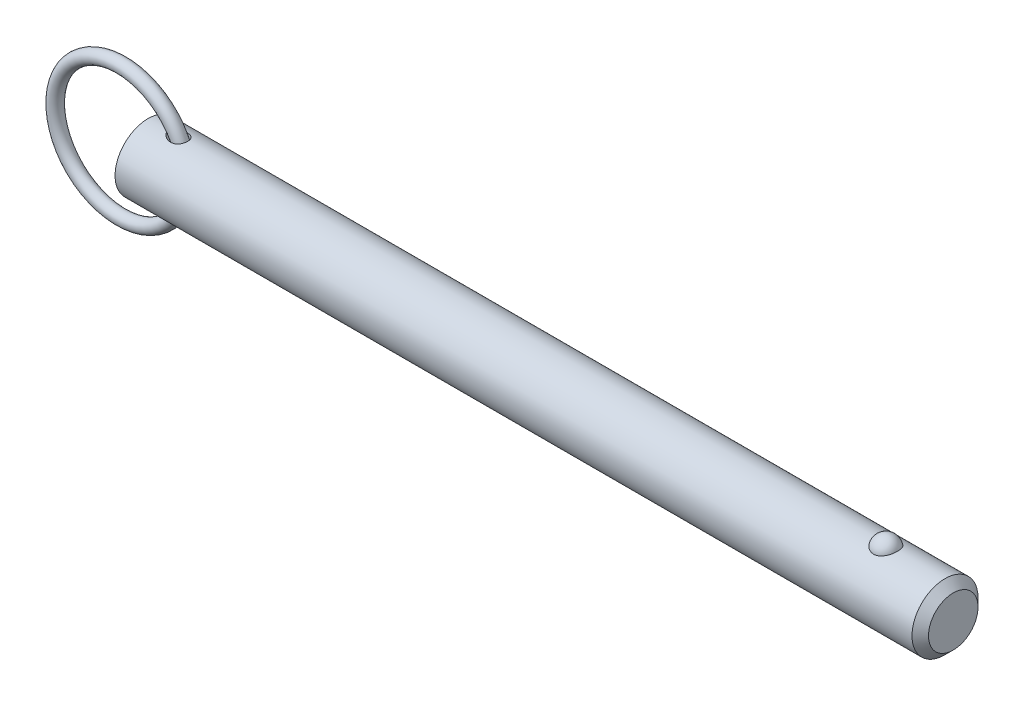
ISO-10303-21;
HEADER;
FILE_DESCRIPTION(('STEP AP214'),'2;1');
FILE_NAME('part.step','',(''),(''),'','','');
FILE_SCHEMA(('AUTOMOTIVE_DESIGN { 1 0 10303 214 1 1 1 1 }'));
ENDSEC;
DATA;
#1=APPLICATION_CONTEXT('core data for automotive mechanical design processes');
#2=APPLICATION_PROTOCOL_DEFINITION('international standard','automotive_design',2000,#1);
#3=PRODUCT_CONTEXT('',#1,'mechanical');
#4=PRODUCT('Part','Part','',(#3));
#5=PRODUCT_RELATED_PRODUCT_CATEGORY('part','',(#4));
#6=PRODUCT_DEFINITION_FORMATION('','',#4);
#7=PRODUCT_DEFINITION_CONTEXT('part definition',#1,'design');
#8=PRODUCT_DEFINITION('design','',#6,#7);
#9=PRODUCT_DEFINITION_SHAPE('','',#8);
#10=(LENGTH_UNIT() NAMED_UNIT(*) SI_UNIT(.MILLI.,.METRE.));
#11=(NAMED_UNIT(*) PLANE_ANGLE_UNIT() SI_UNIT($,.RADIAN.));
#12=(NAMED_UNIT(*) SI_UNIT($,.STERADIAN.) SOLID_ANGLE_UNIT());
#13=UNCERTAINTY_MEASURE_WITH_UNIT(LENGTH_MEASURE(1.E-05),#10,'distance_accuracy_value','');
#14=(GEOMETRIC_REPRESENTATION_CONTEXT(3) GLOBAL_UNCERTAINTY_ASSIGNED_CONTEXT((#13)) GLOBAL_UNIT_ASSIGNED_CONTEXT((#10,
#11,#12)) REPRESENTATION_CONTEXT('',''));
#15=CARTESIAN_POINT('',(0.,0.,0.));
#16=DIRECTION('',(0.,0.,1.));
#17=DIRECTION('',(1.,0.,0.));
#18=AXIS2_PLACEMENT_3D('',#15,#16,#17);
#19=CARTESIAN_POINT('',(-6.46799987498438,0.,0.));
#20=DIRECTION('',(0.,0.,1.));
#21=DIRECTION('',(1.,0.,0.));
#22=AXIS2_PLACEMENT_3D('',#19,#20,#21);
#23=TOROIDAL_SURFACE('',#22,15.875,1.588);
#24=CARTESIAN_POINT('',(10.9950001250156,0.,0.));
#25=VERTEX_POINT('',#24);
#26=VERTEX_LOOP('',#25);
#27=FACE_BOUND('',#26,.T.);
#28=ADVANCED_FACE('P0_F12',(#27),#23,.T.);
#29=CLOSED_SHELL('',(#28));
#30=MANIFOLD_SOLID_BREP('P0_B1',#29);
#31=CARTESIAN_POINT('',(0.,0.,0.));
#32=DIRECTION('',(1.,0.,0.));
#33=DIRECTION('',(0.,0.,-1.));
#34=AXIS2_PLACEMENT_3D('',#31,#32,#33);
#35=CYLINDRICAL_SURFACE('',#34,7.94);
#36=CARTESIAN_POINT('',(5.37881269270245,7.8641200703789,-1.0950869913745));
#37=CARTESIAN_POINT('',(5.49078530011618,7.84653010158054,-1.22142628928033));
#38=CARTESIAN_POINT('',(5.61742164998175,7.82766483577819,-1.33478448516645));
#39=CARTESIAN_POINT('',(5.82155225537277,7.80005811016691,-1.48501770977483));
#40=CARTESIAN_POINT('',(5.89211597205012,7.79095331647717,-1.53186949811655));
#41=CARTESIAN_POINT('',(6.03726296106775,7.77331484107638,-1.61899652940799));
#42=CARTESIAN_POINT('',(6.11184478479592,7.76478095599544,-1.65927412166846));
#43=CARTESIAN_POINT('',(6.31831542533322,7.74290334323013,-1.75933205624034));
#44=CARTESIAN_POINT('',(6.45343253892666,7.73042593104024,-1.81276183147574));
#45=CARTESIAN_POINT('',(6.73017339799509,7.70966096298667,-1.89912673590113));
#46=CARTESIAN_POINT('',(6.87179099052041,7.70136953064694,-1.93208083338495));
#47=CARTESIAN_POINT('',(7.17522096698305,7.6896684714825,-1.97820987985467));
#48=CARTESIAN_POINT('',(7.33750100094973,7.68691980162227,-1.98871513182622));
#49=CARTESIAN_POINT('',(7.57994245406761,7.68880305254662,-1.98137951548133));
#50=CARTESIAN_POINT('',(7.66059155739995,7.69043175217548,-1.97508575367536));
#51=CARTESIAN_POINT('',(7.82077465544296,7.69570110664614,-1.95445819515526));
#52=CARTESIAN_POINT('',(7.9003091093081,7.69934090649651,-1.94012781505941));
#53=CARTESIAN_POINT('',(8.09280087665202,7.71066069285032,-1.89475688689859));
#54=CARTESIAN_POINT('',(8.20465204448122,7.71942251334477,-1.85909462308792));
#55=CARTESIAN_POINT('',(8.42059371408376,7.74035594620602,-1.7699066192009));
#56=CARTESIAN_POINT('',(8.52468939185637,7.75252525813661,-1.7163929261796));
#57=CARTESIAN_POINT('',(8.72211003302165,7.77903750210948,-1.59192358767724));
#58=CARTESIAN_POINT('',(8.81539818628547,7.79338749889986,-1.52091076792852));
#59=CARTESIAN_POINT('',(8.98759177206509,7.8225086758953,-1.36321590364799));
#60=CARTESIAN_POINT('',(9.06649712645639,7.83727985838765,-1.27653377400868));
#61=CARTESIAN_POINT('',(9.20311499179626,7.86453692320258,-1.09567667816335));
#62=CARTESIAN_POINT('',(9.26180839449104,7.8771064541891,-1.00225329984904));
#63=CARTESIAN_POINT('',(9.36257622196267,7.89954213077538,-0.8065472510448));
#64=CARTESIAN_POINT('',(9.40465301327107,7.9094086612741,-0.704265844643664));
#65=CARTESIAN_POINT('',(9.47062404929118,7.92520709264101,-0.495461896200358));
#66=CARTESIAN_POINT('',(9.49478817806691,7.9311972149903,-0.389028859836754));
#67=CARTESIAN_POINT('',(9.52544004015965,7.93883641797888,-0.173494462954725));
#68=CARTESIAN_POINT('',(9.5319278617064,7.94048552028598,-0.0643931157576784));
#69=CARTESIAN_POINT('',(9.52707996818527,7.93926454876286,0.153487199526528));
#70=CARTESIAN_POINT('',(9.51572796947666,7.93639034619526,0.26226578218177));
#71=CARTESIAN_POINT('',(9.47542322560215,7.92642470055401,0.476313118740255));
#72=CARTESIAN_POINT('',(9.44647056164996,7.91933327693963,0.581581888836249));
#73=CARTESIAN_POINT('',(9.3716401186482,7.90170355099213,0.785602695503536));
#74=CARTESIAN_POINT('',(9.32576415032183,7.89116561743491,0.884355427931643));
#75=CARTESIAN_POINT('',(9.21823065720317,7.8677977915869,1.07254831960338));
#76=CARTESIAN_POINT('',(9.15657431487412,7.85496807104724,1.16198917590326));
#77=CARTESIAN_POINT('',(9.01919194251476,7.82843688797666,1.32903649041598));
#78=CARTESIAN_POINT('',(8.94347744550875,7.81473614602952,1.40665255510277));
#79=CARTESIAN_POINT('',(8.78012086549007,7.7879321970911,1.5481977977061));
#80=CARTESIAN_POINT('',(8.69247914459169,7.77482897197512,1.61212739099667));
#81=CARTESIAN_POINT('',(8.50642314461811,7.75037063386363,1.72592270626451));
#82=CARTESIAN_POINT('',(8.40786430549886,7.73904540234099,1.77555777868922));
#83=CARTESIAN_POINT('',(8.2039870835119,7.71943979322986,1.85894844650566));
#84=CARTESIAN_POINT('',(8.0986670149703,7.7111601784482,1.89270006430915));
#85=CARTESIAN_POINT('',(7.87703213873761,7.69782475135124,1.94625652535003));
#86=CARTESIAN_POINT('',(7.76044899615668,7.69301557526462,1.96500324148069));
#87=CARTESIAN_POINT('',(7.52574256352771,7.68770484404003,1.98567257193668));
#88=CARTESIAN_POINT('',(7.40761868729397,7.68720497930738,1.98758858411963));
#89=CARTESIAN_POINT('',(7.15639592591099,7.69044495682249,1.97502233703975));
#90=CARTESIAN_POINT('',(7.02341871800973,7.69476380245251,1.9583009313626));
#91=CARTESIAN_POINT('',(6.7612589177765,7.70776394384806,1.90648094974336));
#92=CARTESIAN_POINT('',(6.6320804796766,7.71644984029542,1.87136299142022));
#93=CARTESIAN_POINT('',(6.35978215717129,7.73875442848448,1.77707737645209));
#94=CARTESIAN_POINT('',(6.2177212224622,7.75293863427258,1.71496895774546));
#95=CARTESIAN_POINT('',(5.94559201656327,7.78383102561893,1.56880760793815));
#96=CARTESIAN_POINT('',(5.81552062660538,7.80053855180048,1.48476040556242));
#97=CARTESIAN_POINT('',(5.60081087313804,7.83035955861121,1.31701356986));
#98=CARTESIAN_POINT('',(5.51265224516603,7.84340226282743,1.23780647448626));
#99=CARTESIAN_POINT('',(5.34976240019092,7.86852524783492,1.06647953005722));
#100=CARTESIAN_POINT('',(5.27500719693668,7.88060722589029,0.974383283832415));
#101=CARTESIAN_POINT('',(5.15877594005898,7.89990441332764,0.800548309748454));
#102=CARTESIAN_POINT('',(5.11360209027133,7.90759876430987,0.721348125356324));
#103=CARTESIAN_POINT('',(5.03655060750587,7.92090267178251,0.556518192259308));
#104=CARTESIAN_POINT('',(5.00466157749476,7.92651401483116,0.470894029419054));
#105=CARTESIAN_POINT('',(4.95653766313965,7.93503671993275,0.294356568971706));
#106=CARTESIAN_POINT('',(4.94043621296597,7.93792505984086,0.203404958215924));
#107=CARTESIAN_POINT('',(4.92605720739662,7.94050250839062,0.0200631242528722));
#108=CARTESIAN_POINT('',(4.92776929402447,7.9401934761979,-0.072326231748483));
#109=CARTESIAN_POINT('',(4.94742735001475,7.93667454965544,-0.24325091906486));
#110=CARTESIAN_POINT('',(4.96327131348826,7.93384031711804,-0.32204819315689));
#111=CARTESIAN_POINT('',(5.00707570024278,7.92609115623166,-0.47605810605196));
#112=CARTESIAN_POINT('',(5.0350396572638,7.92117562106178,-0.551269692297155));
#113=CARTESIAN_POINT('',(5.10737112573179,7.90866290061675,-0.70999547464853));
#114=CARTESIAN_POINT('',(5.15379379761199,7.90074105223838,-0.792541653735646));
#115=CARTESIAN_POINT('',(5.2582083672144,7.88338732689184,-0.949781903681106));
#116=CARTESIAN_POINT('',(5.31621941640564,7.87395295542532,-1.02446265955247));
#117=CARTESIAN_POINT('',(5.37881269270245,7.8641200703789,-1.0950869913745));
#118=B_SPLINE_CURVE_WITH_KNOTS('',3,(#36,#37,#38,#39,#40,#41,#42,#43,#44,#45,#46,#47,#48,#49,
#50,#51,#52,#53,#54,#55,#56,#57,#58,#59,#60,#61,#62,#63,#64,#65,#66,#67,#68,#69,#70,#71,#72,#73,
#74,#75,#76,#77,#78,#79,#80,#81,#82,#83,#84,#85,#86,#87,#88,#89,#90,#91,#92,#93,#94,#95,#96,#97,
#98,#99,#100,#101,#102,#103,#104,#105,#106,#107,#108,#109,#110,#111,#112,#113,#114,#115,#116,
#117),.UNSPECIFIED.,.T.,.F.,(4,2,2,2,2,2,2,2,2,2,2,2,2,2,2,2,2,2,2,2,2,2,2,2,2,2,2,2,2,2,2,2,2,
2,2,2,2,2,2,2,4),(0.,0.508599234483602,0.763935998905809,1.01918131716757,1.45492798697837,
1.89027038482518,2.37502798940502,2.61739702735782,2.8596631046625,3.21120678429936,
3.56251370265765,3.91498401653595,4.26745624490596,4.59897839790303,4.93045331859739,
5.2568264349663,5.58319792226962,5.909867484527,6.23653553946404,6.56316865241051,
6.88977729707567,7.21611917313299,7.54245114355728,7.87378632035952,8.20520442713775,
8.55832700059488,8.91158808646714,9.31234018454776,9.71351536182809,10.1786231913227,
10.6436096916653,11.0001264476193,11.3559986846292,11.6294791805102,11.9027245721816,
12.1782599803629,12.4536351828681,12.693828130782,12.9340911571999,13.2179277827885,
13.5022374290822),.UNSPECIFIED.);
#119=CARTESIAN_POINT('',(5.37881269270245,7.8641200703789,-1.0950869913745));
#120=VERTEX_POINT('',#119);
#121=EDGE_CURVE('P1_E40',#120,#120,#118,.T.);
#122=ORIENTED_EDGE('',*,*,#121,.T.);
#123=EDGE_LOOP('',(#122));
#124=FACE_BOUND('',#123,.T.);
#125=CARTESIAN_POINT('',(191.695,0.,0.));
#126=DIRECTION('',(1.,0.,0.));
#127=DIRECTION('',(0.,0.,-1.));
#128=AXIS2_PLACEMENT_3D('',#125,#126,#127);
#129=CIRCLE('',#128,7.94);
#130=CARTESIAN_POINT('',(191.695,0.,-7.94));
#131=VERTEX_POINT('',#130);
#132=EDGE_CURVE('P1_E25',#131,#131,#129,.T.);
#133=ORIENTED_EDGE('',*,*,#132,.F.);
#134=EDGE_LOOP('',(#133));
#135=FACE_BOUND('',#134,.T.);
#136=CARTESIAN_POINT('',(0.,0.,0.));
#137=DIRECTION('',(1.,0.,0.));
#138=DIRECTION('',(0.,0.,-1.));
#139=AXIS2_PLACEMENT_3D('',#136,#137,#138);
#140=CIRCLE('',#139,7.94);
#141=CARTESIAN_POINT('',(0.,0.,-7.94));
#142=VERTEX_POINT('',#141);
#143=EDGE_CURVE('P1_E9',#142,#142,#140,.T.);
#144=ORIENTED_EDGE('',*,*,#143,.T.);
#145=EDGE_LOOP('',(#144));
#146=FACE_BOUND('',#145,.T.);
#147=CARTESIAN_POINT('',(177.464907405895,7.37767842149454,2.93486986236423));
#148=CARTESIAN_POINT('',(177.312749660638,7.3776732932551,2.93487505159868));
#149=CARTESIAN_POINT('',(177.160632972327,7.38258419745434,2.92262454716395));
#150=CARTESIAN_POINT('',(176.860928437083,7.40163229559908,2.87404196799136));
#151=CARTESIAN_POINT('',(176.713339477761,7.41576720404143,2.83771585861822));
#152=CARTESIAN_POINT('',(176.427018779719,7.45161576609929,2.74218769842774));
#153=CARTESIAN_POINT('',(176.288274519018,7.47331841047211,2.68301886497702));
#154=CARTESIAN_POINT('',(176.022882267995,7.52194082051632,2.54350967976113));
#155=CARTESIAN_POINT('',(175.896236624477,7.54886159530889,2.46316523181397));
#156=CARTESIAN_POINT('',(175.654534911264,7.60594671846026,2.28090375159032));
#157=CARTESIAN_POINT('',(175.539906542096,7.63618114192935,2.1784421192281));
#158=CARTESIAN_POINT('',(175.328878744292,7.69614046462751,1.95608495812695));
#159=CARTESIAN_POINT('',(175.232482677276,7.72586526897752,1.83618622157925));
#160=CARTESIAN_POINT('',(175.055938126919,7.78314821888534,1.57628086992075));
#161=CARTESIAN_POINT('',(174.976707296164,7.81055035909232,1.43561546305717));
#162=CARTESIAN_POINT('',(174.841797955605,7.85879631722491,1.142363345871));
#163=CARTESIAN_POINT('',(174.786121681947,7.87963951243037,0.989775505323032));
#164=CARTESIAN_POINT('',(174.69881215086,7.91289645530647,0.674619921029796));
#165=CARTESIAN_POINT('',(174.66753090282,7.92518652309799,0.511941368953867));
#166=CARTESIAN_POINT('',(174.630975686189,7.93958930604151,0.18324773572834));
#167=CARTESIAN_POINT('',(174.625701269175,7.94170219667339,0.0172327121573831));
#168=CARTESIAN_POINT('',(174.641231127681,7.93554931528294,-0.31267286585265));
#169=CARTESIAN_POINT('',(174.661925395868,7.92732732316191,-0.476569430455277));
#170=CARTESIAN_POINT('',(174.72878655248,7.90141534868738,-0.798305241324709));
#171=CARTESIAN_POINT('',(174.774953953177,7.88372517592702,-0.956144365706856));
#172=CARTESIAN_POINT('',(174.891898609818,7.84066230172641,-1.26152073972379));
#173=CARTESIAN_POINT('',(174.962704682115,7.81528060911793,-1.40904568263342));
#174=CARTESIAN_POINT('',(175.127478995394,7.75948672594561,-1.68950598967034));
#175=CARTESIAN_POINT('',(175.221448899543,7.72907417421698,-1.82244030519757));
#176=CARTESIAN_POINT('',(175.430839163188,7.66640424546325,-2.07032792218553));
#177=CARTESIAN_POINT('',(175.546315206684,7.63414223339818,-2.18523308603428));
#178=CARTESIAN_POINT('',(175.7959006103,7.57149681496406,-2.39329737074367));
#179=CARTESIAN_POINT('',(175.930008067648,7.54111321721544,-2.48645870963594));
#180=CARTESIAN_POINT('',(176.210111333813,7.48650742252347,-2.64628132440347));
#181=CARTESIAN_POINT('',(176.355760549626,7.46215900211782,-2.71350554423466));
#182=CARTESIAN_POINT('',(176.657425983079,7.42171253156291,-2.82226614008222));
#183=CARTESIAN_POINT('',(176.813438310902,7.40561140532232,-2.86381209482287));
#184=CARTESIAN_POINT('',(177.122970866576,7.3842679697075,-2.9183907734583));
#185=CARTESIAN_POINT('',(177.276222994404,7.37852109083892,-2.93275024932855));
#186=CARTESIAN_POINT('',(177.583070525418,7.37700973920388,-2.93655208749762));
#187=CARTESIAN_POINT('',(177.736665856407,7.38124333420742,-2.92599927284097));
#188=CARTESIAN_POINT('',(178.034990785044,7.39890635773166,-2.88102897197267));
#189=CARTESIAN_POINT('',(178.179848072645,7.41205491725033,-2.8473399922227));
#190=CARTESIAN_POINT('',(178.46164329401,7.445801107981,-2.7578820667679));
#191=CARTESIAN_POINT('',(178.598580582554,7.46639934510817,-2.70211132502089));
#192=CARTESIAN_POINT('',(178.864061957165,7.51339098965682,-2.56858908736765));
#193=CARTESIAN_POINT('',(178.992354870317,7.53990200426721,-2.4903806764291));
#194=CARTESIAN_POINT('',(179.234244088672,7.59569503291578,-2.31462737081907));
#195=CARTESIAN_POINT('',(179.347837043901,7.6249776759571,-2.21707808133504));
#196=CARTESIAN_POINT('',(179.56322156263,7.68489473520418,-1.99982049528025));
#197=CARTESIAN_POINT('',(179.664148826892,7.71552419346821,-1.87925337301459));
#198=CARTESIAN_POINT('',(179.845186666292,7.77353016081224,-1.62268826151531));
#199=CARTESIAN_POINT('',(179.925293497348,7.80090608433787,-1.48668750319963));
#200=CARTESIAN_POINT('',(180.065361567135,7.85047992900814,-1.1981841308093));
#201=CARTESIAN_POINT('',(180.124587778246,7.87248183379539,-1.04529016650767));
#202=CARTESIAN_POINT('',(180.217982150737,7.90785114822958,-0.731080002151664));
#203=CARTESIAN_POINT('',(180.252149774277,7.92121837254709,-0.56976362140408));
#204=CARTESIAN_POINT('',(180.294795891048,7.93797834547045,-0.242812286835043));
#205=CARTESIAN_POINT('',(180.303204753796,7.94134405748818,-0.0771668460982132));
#206=CARTESIAN_POINT('',(180.293962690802,7.93767937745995,0.253276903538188));
#207=CARTESIAN_POINT('',(180.276312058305,7.93064910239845,0.418075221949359));
#208=CARTESIAN_POINT('',(180.215424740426,7.90695571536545,0.741525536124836));
#209=CARTESIAN_POINT('',(180.172281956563,7.8903279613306,0.900197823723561));
#210=CARTESIAN_POINT('',(180.06135358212,7.84916386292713,1.20759654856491));
#211=CARTESIAN_POINT('',(179.99356656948,7.82462706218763,1.35632241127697));
#212=CARTESIAN_POINT('',(179.834371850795,7.7700669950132,1.64032869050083));
#213=CARTESIAN_POINT('',(179.742861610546,7.74002008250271,1.77554712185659));
#214=CARTESIAN_POINT('',(179.538296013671,7.67774175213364,2.02800648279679));
#215=CARTESIAN_POINT('',(179.425241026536,7.64551037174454,2.14524772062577));
#216=CARTESIAN_POINT('',(179.180831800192,7.58265895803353,2.35778002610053));
#217=CARTESIAN_POINT('',(179.049583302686,7.5520309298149,2.45319004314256));
#218=CARTESIAN_POINT('',(178.771601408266,7.49579792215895,2.61999897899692));
#219=CARTESIAN_POINT('',(178.624867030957,7.47019326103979,2.69139637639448));
#220=CARTESIAN_POINT('',(178.312947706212,7.42622216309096,2.8105324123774));
#221=CARTESIAN_POINT('',(178.147220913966,7.40825002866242,2.85700910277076));
#222=CARTESIAN_POINT('',(177.809279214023,7.38398348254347,2.9191685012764));
#223=CARTESIAN_POINT('',(177.63706702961,7.3776842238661,2.93486399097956));
#224=CARTESIAN_POINT('',(177.464907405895,7.37767842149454,2.93486986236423));
#225=B_SPLINE_CURVE_WITH_KNOTS('',3,(#147,#148,#149,#150,#151,#152,#153,#154,#155,#156,#157,
#158,#159,#160,#161,#162,#163,#164,#165,#166,#167,#168,#169,#170,#171,#172,#173,#174,#175,#176,
#177,#178,#179,#180,#181,#182,#183,#184,#185,#186,#187,#188,#189,#190,#191,#192,#193,#194,#195,
#196,#197,#198,#199,#200,#201,#202,#203,#204,#205,#206,#207,#208,#209,#210,#211,#212,#213,#214,
#215,#216,#217,#218,#219,#220,#221,#222,#223,#224),.UNSPECIFIED.,.T.,.F.,(4,2,2,2,2,2,2,2,2,2,2,
2,2,2,2,2,2,2,2,2,2,2,2,2,2,2,2,2,2,2,2,2,2,2,2,2,2,2,4),(0.,0.45584132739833,0.911569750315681,
1.36663794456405,1.82179423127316,2.28978983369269,2.75787163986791,3.24685368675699,
3.73588214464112,4.23184282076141,4.72779494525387,5.22165321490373,5.71552141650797,
6.20996917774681,6.7044524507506,7.20023431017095,7.69596557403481,8.18023418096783,
8.66432203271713,9.12410697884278,9.58380291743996,10.0296503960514,10.4755341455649,
10.9312349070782,11.3870393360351,11.8654416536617,12.3439299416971,12.8378875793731,
13.3318558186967,13.8271581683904,14.3224549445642,14.8159385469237,15.3094506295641,
15.8051323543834,16.3008055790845,16.7937101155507,17.2866458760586,17.8026240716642,
18.3183879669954),.UNSPECIFIED.);
#226=CARTESIAN_POINT('',(177.464907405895,7.37767842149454,2.93486986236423));
#227=VERTEX_POINT('',#226);
#228=EDGE_CURVE('P1_E34',#227,#227,#225,.T.);
#229=ORIENTED_EDGE('',*,*,#228,.T.);
#230=EDGE_LOOP('',(#229));
#231=FACE_BOUND('',#230,.T.);
#232=CARTESIAN_POINT('',(5.37881269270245,-7.8641200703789,-1.0950869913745));
#233=CARTESIAN_POINT('',(5.31532711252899,-7.87409326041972,-1.02345575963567));
#234=CARTESIAN_POINT('',(5.25654962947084,-7.88365715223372,-0.947641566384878));
#235=CARTESIAN_POINT('',(5.15093536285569,-7.90122221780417,-0.787865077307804));
#236=CARTESIAN_POINT('',(5.10408931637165,-7.90922460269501,-0.703909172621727));
#237=CARTESIAN_POINT('',(5.02499142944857,-7.92292057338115,-0.527991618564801));
#238=CARTESIAN_POINT('',(4.99290048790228,-7.92858863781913,-0.435954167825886));
#239=CARTESIAN_POINT('',(4.94718343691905,-7.93670712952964,-0.247266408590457));
#240=CARTESIAN_POINT('',(4.93353142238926,-7.93916207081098,-0.150622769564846));
#241=CARTESIAN_POINT('',(4.92669426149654,-7.94038957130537,0.0306459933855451));
#242=CARTESIAN_POINT('',(4.93105622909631,-7.93960347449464,0.115182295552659));
#243=CARTESIAN_POINT('',(4.95441758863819,-7.93542535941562,0.282133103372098));
#244=CARTESIAN_POINT('',(4.97342060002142,-7.93203269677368,0.364547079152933));
#245=CARTESIAN_POINT('',(5.02337664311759,-7.92322764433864,0.521528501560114));
#246=CARTESIAN_POINT('',(5.05377582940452,-7.91790920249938,0.596281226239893));
#247=CARTESIAN_POINT('',(5.1246872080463,-7.90571364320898,0.740640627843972));
#248=CARTESIAN_POINT('',(5.16520358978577,-7.89883588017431,0.81024515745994));
#249=CARTESIAN_POINT('',(5.27792634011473,-7.88012470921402,0.978620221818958));
#250=CARTESIAN_POINT('',(5.35563200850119,-7.86757912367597,1.07363778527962));
#251=CARTESIAN_POINT('',(5.52523836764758,-7.84150676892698,1.24994147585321));
#252=CARTESIAN_POINT('',(5.61717506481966,-7.82797755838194,1.33119164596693));
#253=CARTESIAN_POINT('',(5.8391371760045,-7.79742756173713,1.50104748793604));
#254=CARTESIAN_POINT('',(5.9725742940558,-7.78050347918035,1.58521567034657));
#255=CARTESIAN_POINT('',(6.25160600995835,-7.74942135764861,1.73078109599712));
#256=CARTESIAN_POINT('',(6.39720857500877,-7.73526515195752,1.79216327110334));
#257=CARTESIAN_POINT('',(6.69793322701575,-7.7116170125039,1.89134478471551));
#258=CARTESIAN_POINT('',(6.85312134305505,-7.70216275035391,1.92895428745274));
#259=CARTESIAN_POINT('',(7.16781951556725,-7.68988337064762,1.97736316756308));
#260=CARTESIAN_POINT('',(7.32732244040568,-7.68704791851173,1.98820434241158));
#261=CARTESIAN_POINT('',(7.61290770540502,-7.68890797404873,1.98097687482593));
#262=CARTESIAN_POINT('',(7.73913797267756,-7.69217875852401,1.96837928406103));
#263=CARTESIAN_POINT('',(7.98774248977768,-7.70364253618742,1.92303262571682));
#264=CARTESIAN_POINT('',(8.11011880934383,-7.71183283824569,1.89029457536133));
#265=CARTESIAN_POINT('',(8.34766306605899,-7.73253074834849,1.80375920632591));
#266=CARTESIAN_POINT('',(8.46278682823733,-7.74506226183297,1.74984505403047));
#267=CARTESIAN_POINT('',(8.6806268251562,-7.77294147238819,1.62149891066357));
#268=CARTESIAN_POINT('',(8.78334736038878,-7.78828818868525,1.54707406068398));
#269=CARTESIAN_POINT('',(8.96275951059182,-7.81808719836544,1.38814746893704));
#270=CARTESIAN_POINT('',(9.0410292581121,-7.83247448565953,1.30540890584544));
#271=CARTESIAN_POINT('',(9.18176824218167,-7.86008608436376,1.12727331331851));
#272=CARTESIAN_POINT('',(9.24424163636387,-7.87331070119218,1.03187962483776));
#273=CARTESIAN_POINT('',(9.34924815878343,-7.89649032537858,0.835684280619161));
#274=CARTESIAN_POINT('',(9.39252490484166,-7.90656172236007,0.735293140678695));
#275=CARTESIAN_POINT('',(9.46188913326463,-7.92307290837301,0.528458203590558));
#276=CARTESIAN_POINT('',(9.48797767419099,-7.92951292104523,0.422014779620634));
#277=CARTESIAN_POINT('',(9.5222867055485,-7.93804067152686,0.20658939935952));
#278=CARTESIAN_POINT('',(9.53058328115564,-7.94014694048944,0.0976202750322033));
#279=CARTESIAN_POINT('',(9.52935292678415,-7.93983698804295,-0.120212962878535));
#280=CARTESIAN_POINT('',(9.51982577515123,-7.93742071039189,-0.229077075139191));
#281=CARTESIAN_POINT('',(9.48313466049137,-7.92831916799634,-0.44375138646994));
#282=CARTESIAN_POINT('',(9.45594838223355,-7.92162850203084,-0.549557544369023));
#283=CARTESIAN_POINT('',(9.3845465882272,-7.90469917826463,-0.754954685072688));
#284=CARTESIAN_POINT('',(9.34033171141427,-7.89446065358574,-0.854545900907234));
#285=CARTESIAN_POINT('',(9.23602927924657,-7.87157146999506,-1.04456732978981));
#286=CARTESIAN_POINT('',(9.17596171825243,-7.85892385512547,-1.13500888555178));
#287=CARTESIAN_POINT('',(9.04153430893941,-7.83259746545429,-1.30436780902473));
#288=CARTESIAN_POINT('',(8.96717562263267,-7.81891877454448,-1.38328611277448));
#289=CARTESIAN_POINT('',(8.80603455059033,-7.79196869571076,-1.52782923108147));
#290=CARTESIAN_POINT('',(8.71921490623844,-7.77869867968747,-1.59341269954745));
#291=CARTESIAN_POINT('',(8.53589430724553,-7.7539823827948,-1.7096493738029));
#292=CARTESIAN_POINT('',(8.439392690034,-7.74253622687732,-1.76030155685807));
#293=CARTESIAN_POINT('',(8.23614706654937,-7.72219212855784,-1.84754820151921));
#294=CARTESIAN_POINT('',(8.12916866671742,-7.71339202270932,-1.88361685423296));
#295=CARTESIAN_POINT('',(7.91082287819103,-7.69955300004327,-1.93940887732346));
#296=CARTESIAN_POINT('',(7.79945379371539,-7.69451555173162,-1.95912586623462));
#297=CARTESIAN_POINT('',(7.56409927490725,-7.6881073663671,-1.98413612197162));
#298=CARTESIAN_POINT('',(7.43993744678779,-7.68713944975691,-1.98784574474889));
#299=CARTESIAN_POINT('',(7.19239878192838,-7.68969629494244,-1.97792309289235));
#300=CARTESIAN_POINT('',(7.06902225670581,-7.69322274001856,-1.96428432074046));
#301=CARTESIAN_POINT('',(6.80624991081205,-7.70498367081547,-1.91768089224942));
#302=CARTESIAN_POINT('',(6.66736121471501,-7.71386737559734,-1.88203087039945));
#303=CARTESIAN_POINT('',(6.39625444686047,-7.73551250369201,-1.79098714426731));
#304=CARTESIAN_POINT('',(6.26404857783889,-7.74828074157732,-1.73555871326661));
#305=CARTESIAN_POINT('',(6.06559048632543,-7.77003865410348,-1.63446133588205));
#306=CARTESIAN_POINT('',(5.99591479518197,-7.77821880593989,-1.59522999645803));
#307=CARTESIAN_POINT('',(5.86025875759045,-7.79503524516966,-1.51091846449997));
#308=CARTESIAN_POINT('',(5.79427944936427,-7.8036716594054,-1.46583664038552));
#309=CARTESIAN_POINT('',(5.60322733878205,-7.82978128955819,-1.3219827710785));
#310=CARTESIAN_POINT('',(5.48449649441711,-7.84751780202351,-1.21433077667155));
#311=CARTESIAN_POINT('',(5.37881269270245,-7.8641200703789,-1.0950869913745));
#312=B_SPLINE_CURVE_WITH_KNOTS('',3,(#232,#233,#234,#235,#236,#237,#238,#239,#240,#241,#242,
#243,#244,#245,#246,#247,#248,#249,#250,#251,#252,#253,#254,#255,#256,#257,#258,#259,#260,#261,
#262,#263,#264,#265,#266,#267,#268,#269,#270,#271,#272,#273,#274,#275,#276,#277,#278,#279,#280,
#281,#282,#283,#284,#285,#286,#287,#288,#289,#290,#291,#292,#293,#294,#295,#296,#297,#298,#299,
#300,#301,#302,#303,#304,#305,#306,#307,#308,#309,#310,#311),.UNSPECIFIED.,.T.,.F.,(4,2,2,2,2,2,
2,2,2,2,2,2,2,2,2,2,2,2,2,2,2,2,2,2,2,2,2,2,2,2,2,2,2,2,2,2,2,2,2,4),(0.,0.288363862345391,
0.576503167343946,0.867714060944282,1.15851540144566,1.41111828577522,1.66378363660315,
1.90549406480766,2.1473047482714,2.51540453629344,2.88445136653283,3.35805159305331,
3.83196445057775,4.30961543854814,4.78652012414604,5.16565662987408,5.54458592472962,
5.92563591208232,6.30655339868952,6.64920782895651,6.99177197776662,7.31956587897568,
7.64733959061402,7.97370879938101,8.30008206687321,8.62686856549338,8.95364280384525,
9.28000684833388,9.60634436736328,9.93367879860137,10.261035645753,10.59932199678,
10.9377403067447,11.308967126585,11.6803330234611,12.1096921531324,12.5398088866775,
12.7806650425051,13.0215885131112,13.5016249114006),.UNSPECIFIED.);
#313=CARTESIAN_POINT('',(5.37881269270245,-7.8641200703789,-1.0950869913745));
#314=VERTEX_POINT('',#313);
#315=EDGE_CURVE('P1_E17',#314,#314,#312,.T.);
#316=ORIENTED_EDGE('',*,*,#315,.T.);
#317=EDGE_LOOP('',(#316));
#318=FACE_BOUND('',#317,.T.);
#319=ADVANCED_FACE('P1_F13',(#124,#135,#146,#231,#318),#35,.T.);
#320=CARTESIAN_POINT('',(0.,0.,0.));
#321=DIRECTION('',(-1.,0.,0.));
#322=DIRECTION('',(0.,0.,1.));
#323=AXIS2_PLACEMENT_3D('',#320,#321,#322);
#324=PLANE('',#323);
#325=ORIENTED_EDGE('',*,*,#143,.F.);
#326=EDGE_LOOP('',(#325));
#327=FACE_BOUND('',#326,.T.);
#328=ADVANCED_FACE('P1_F15',(#327),#324,.T.);
#329=CARTESIAN_POINT('',(193.68,0.,0.));
#330=DIRECTION('',(-1.,0.,0.));
#331=DIRECTION('',(0.,0.,1.));
#332=AXIS2_PLACEMENT_3D('',#329,#330,#331);
#333=CONICAL_SURFACE('',#332,5.95500000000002,0.785398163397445);
#334=ORIENTED_EDGE('',*,*,#132,.T.);
#335=EDGE_LOOP('',(#334));
#336=FACE_BOUND('',#335,.T.);
#337=CARTESIAN_POINT('',(193.68,0.,0.));
#338=DIRECTION('',(1.,0.,0.));
#339=DIRECTION('',(0.,0.,-1.));
#340=AXIS2_PLACEMENT_3D('',#337,#338,#339);
#341=CIRCLE('',#340,5.95500000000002);
#342=CARTESIAN_POINT('',(193.68,0.,-5.95500000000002));
#343=VERTEX_POINT('',#342);
#344=EDGE_CURVE('P1_E30',#343,#343,#341,.T.);
#345=ORIENTED_EDGE('',*,*,#344,.F.);
#346=EDGE_LOOP('',(#345));
#347=FACE_BOUND('',#346,.T.);
#348=ADVANCED_FACE('P1_F55',(#336,#347),#333,.T.);
#349=CARTESIAN_POINT('',(193.68,5.95500000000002,0.));
#350=DIRECTION('',(1.,0.,0.));
#351=DIRECTION('',(0.,0.,-1.));
#352=AXIS2_PLACEMENT_3D('',#349,#350,#351);
#353=PLANE('',#352);
#354=ORIENTED_EDGE('',*,*,#344,.T.);
#355=EDGE_LOOP('',(#354));
#356=FACE_BOUND('',#355,.T.);
#357=ADVANCED_FACE('P1_F51',(#356),#353,.T.);
#358=CARTESIAN_POINT('',(177.464907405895,7.146,0.));
#359=DIRECTION('',(-1.,0.,0.));
#360=DIRECTION('',(0.,1.,0.));
#361=AXIS2_PLACEMENT_3D('',#358,#359,#360);
#362=SPHERICAL_SURFACE('',#361,2.944);
#363=ORIENTED_EDGE('',*,*,#228,.F.);
#364=EDGE_LOOP('',(#363));
#365=FACE_BOUND('',#364,.T.);
#366=ADVANCED_FACE('P1_F46',(#365),#362,.T.);
#367=CARTESIAN_POINT('',(-6.46799987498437,0.,0.));
#368=DIRECTION('',(0.,0.,1.));
#369=DIRECTION('',(1.,0.,0.));
#370=AXIS2_PLACEMENT_3D('',#367,#368,#369);
#371=TOROIDAL_SURFACE('',#370,15.875,1.985);
#372=ORIENTED_EDGE('',*,*,#315,.F.);
#373=EDGE_LOOP('',(#372));
#374=FACE_BOUND('',#373,.T.);
#375=ORIENTED_EDGE('',*,*,#121,.F.);
#376=EDGE_LOOP('',(#375));
#377=FACE_BOUND('',#376,.T.);
#378=ADVANCED_FACE('P1_F50',(#374,#377),#371,.F.);
#379=CLOSED_SHELL('',(#319,#328,#348,#357,#366,#378));
#380=MANIFOLD_SOLID_BREP('P1_B1',#379);
#381=ADVANCED_BREP_SHAPE_REPRESENTATION('',(#18,#30,#380),#14);
#382=SHAPE_DEFINITION_REPRESENTATION(#9,#381);
ENDSEC;
END-ISO-10303-21;
